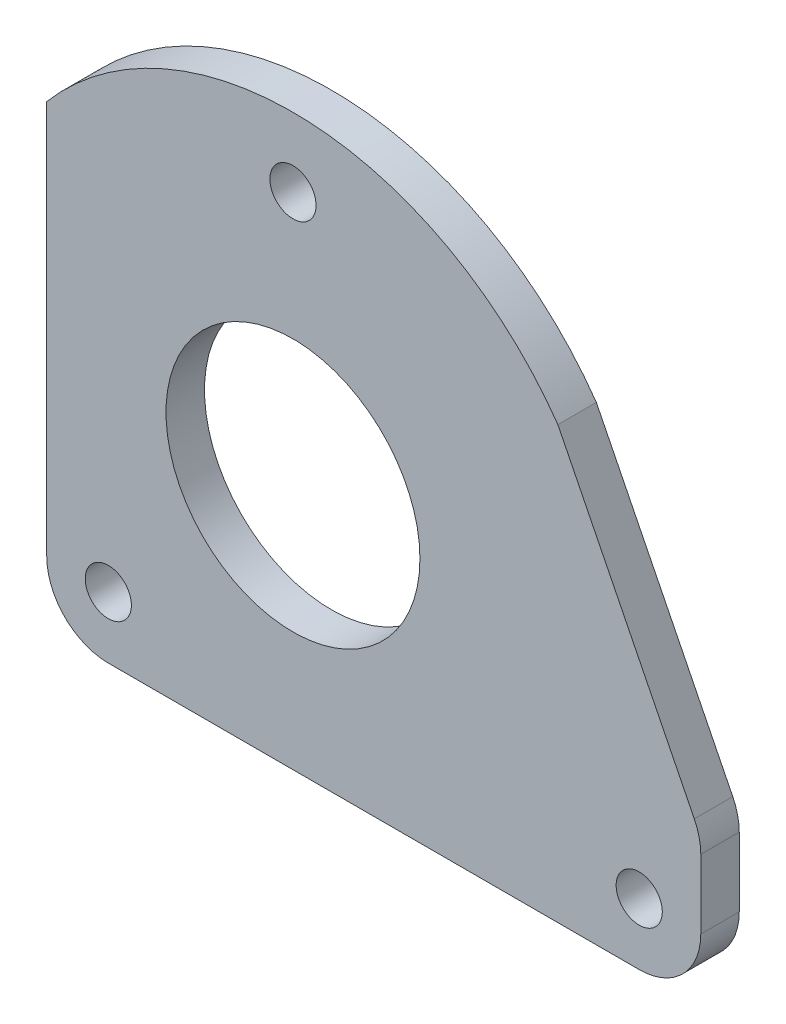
ISO-10303-21;
HEADER;
FILE_DESCRIPTION(('STEP AP214'),'2;1');
FILE_NAME('part.step','',(''),(''),'','','');
FILE_SCHEMA(('AUTOMOTIVE_DESIGN { 1 0 10303 214 1 1 1 1 }'));
ENDSEC;
DATA;
#1=APPLICATION_CONTEXT('core data for automotive mechanical design processes');
#2=APPLICATION_PROTOCOL_DEFINITION('international standard','automotive_design',2000,#1);
#3=PRODUCT_CONTEXT('',#1,'mechanical');
#4=PRODUCT('Part','Part','',(#3));
#5=PRODUCT_RELATED_PRODUCT_CATEGORY('part','',(#4));
#6=PRODUCT_DEFINITION_FORMATION('','',#4);
#7=PRODUCT_DEFINITION_CONTEXT('part definition',#1,'design');
#8=PRODUCT_DEFINITION('design','',#6,#7);
#9=PRODUCT_DEFINITION_SHAPE('','',#8);
#10=(LENGTH_UNIT() NAMED_UNIT(*) SI_UNIT(.MILLI.,.METRE.));
#11=(NAMED_UNIT(*) PLANE_ANGLE_UNIT() SI_UNIT($,.RADIAN.));
#12=(NAMED_UNIT(*) SI_UNIT($,.STERADIAN.) SOLID_ANGLE_UNIT());
#13=UNCERTAINTY_MEASURE_WITH_UNIT(LENGTH_MEASURE(1.E-05),#10,'distance_accuracy_value','');
#14=(GEOMETRIC_REPRESENTATION_CONTEXT(3) GLOBAL_UNCERTAINTY_ASSIGNED_CONTEXT((#13)) GLOBAL_UNIT_ASSIGNED_CONTEXT((#10,
#11,#12)) REPRESENTATION_CONTEXT('',''));
#15=CARTESIAN_POINT('',(0.,0.,0.));
#16=DIRECTION('',(0.,0.,1.));
#17=DIRECTION('',(1.,0.,0.));
#18=AXIS2_PLACEMENT_3D('',#15,#16,#17);
#19=CARTESIAN_POINT('',(-6.69608691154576,-0.438281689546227,0.));
#20=DIRECTION('',(0.,0.,1.));
#21=DIRECTION('',(1.,0.,0.));
#22=AXIS2_PLACEMENT_3D('',#19,#20,#21);
#23=PLANE('',#22);
#24=CARTESIAN_POINT('',(-13.5,0.,0.));
#25=DIRECTION('',(0.,0.,1.));
#26=DIRECTION('',(1.,0.,0.));
#27=AXIS2_PLACEMENT_3D('',#24,#25,#26);
#28=CIRCLE('',#27,42.);
#29=CARTESIAN_POINT('',(20.9268092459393,24.0581546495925,0.));
#30=VERTEX_POINT('',#29);
#31=CARTESIAN_POINT('',(-45.5,27.2029410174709,0.));
#32=VERTEX_POINT('',#31);
#33=EDGE_CURVE('E81',#30,#32,#28,.T.);
#34=ORIENTED_EDGE('',*,*,#33,.F.);
#35=DIRECTION('',(-0.446727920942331,0.894669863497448,0.));
#36=VECTOR('',#35,1.);
#37=CARTESIAN_POINT('',(20.9268092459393,24.0581546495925,0.));
#38=LINE('',#37,#36);
#39=CARTESIAN_POINT('',(38.6573589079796,-11.4511289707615,0.));
#40=VERTEX_POINT('',#39);
#41=EDGE_CURVE('E86',#40,#30,#38,.T.);
#42=ORIENTED_EDGE('',*,*,#41,.F.);
#43=CARTESIAN_POINT('',(31.5,-15.0249523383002,0.));
#44=DIRECTION('',(0.,0.,1.));
#45=DIRECTION('',(1.,0.,0.));
#46=AXIS2_PLACEMENT_3D('',#43,#44,#45);
#47=CIRCLE('',#46,7.99999999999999);
#48=CARTESIAN_POINT('',(39.5,-15.0249523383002,0.));
#49=VERTEX_POINT('',#48);
#50=EDGE_CURVE('E104',#49,#40,#47,.T.);
#51=ORIENTED_EDGE('',*,*,#50,.F.);
#52=DIRECTION('',(0.,1.,0.));
#53=VECTOR('',#52,1.);
#54=CARTESIAN_POINT('',(39.5,-15.0249523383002,0.));
#55=LINE('',#54,#53);
#56=CARTESIAN_POINT('',(39.5,-24.,0.));
#57=VERTEX_POINT('',#56);
#58=EDGE_CURVE('E109',#57,#49,#55,.T.);
#59=ORIENTED_EDGE('',*,*,#58,.F.);
#60=CARTESIAN_POINT('',(31.5,-24.,0.));
#61=DIRECTION('',(0.,0.,1.));
#62=DIRECTION('',(1.,0.,0.));
#63=AXIS2_PLACEMENT_3D('',#60,#61,#62);
#64=CIRCLE('',#63,8.);
#65=CARTESIAN_POINT('',(31.5,-32.,0.));
#66=VERTEX_POINT('',#65);
#67=EDGE_CURVE('E143',#66,#57,#64,.T.);
#68=ORIENTED_EDGE('',*,*,#67,.F.);
#69=DIRECTION('',(1.,0.,0.));
#70=VECTOR('',#69,1.);
#71=CARTESIAN_POINT('',(31.5,-32.,0.));
#72=LINE('',#71,#70);
#73=CARTESIAN_POINT('',(-37.5,-32.,0.));
#74=VERTEX_POINT('',#73);
#75=EDGE_CURVE('E113',#74,#66,#72,.T.);
#76=ORIENTED_EDGE('',*,*,#75,.F.);
#77=CARTESIAN_POINT('',(-37.5,-24.,0.));
#78=DIRECTION('',(0.,0.,1.));
#79=DIRECTION('',(1.,0.,0.));
#80=AXIS2_PLACEMENT_3D('',#77,#78,#79);
#81=CIRCLE('',#80,7.99999999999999);
#82=CARTESIAN_POINT('',(-45.5,-24.,0.));
#83=VERTEX_POINT('',#82);
#84=EDGE_CURVE('E145',#83,#74,#81,.T.);
#85=ORIENTED_EDGE('',*,*,#84,.F.);
#86=DIRECTION('',(0.,-1.,0.));
#87=VECTOR('',#86,1.);
#88=CARTESIAN_POINT('',(-45.5,-24.,0.));
#89=LINE('',#88,#87);
#90=EDGE_CURVE('E88',#32,#83,#89,.T.);
#91=ORIENTED_EDGE('',*,*,#90,.F.);
#92=EDGE_LOOP('',(#34,#42,#51,#59,#68,#76,#85,#91));
#93=FACE_BOUND('',#92,.T.);
#94=CARTESIAN_POINT('',(-37.5,-24.,0.));
#95=DIRECTION('',(0.,0.,1.));
#96=DIRECTION('',(1.,0.,0.));
#97=AXIS2_PLACEMENT_3D('',#94,#95,#96);
#98=CIRCLE('',#97,3.);
#99=CARTESIAN_POINT('',(-34.5,-24.,0.));
#100=VERTEX_POINT('',#99);
#101=EDGE_CURVE('E92',#100,#100,#98,.T.);
#102=ORIENTED_EDGE('',*,*,#101,.T.);
#103=EDGE_LOOP('',(#102));
#104=FACE_BOUND('',#103,.T.);
#105=CARTESIAN_POINT('',(31.5,-24.,0.));
#106=DIRECTION('',(0.,0.,1.));
#107=DIRECTION('',(1.,0.,0.));
#108=AXIS2_PLACEMENT_3D('',#105,#106,#107);
#109=CIRCLE('',#108,3.);
#110=CARTESIAN_POINT('',(34.5,-24.,0.));
#111=VERTEX_POINT('',#110);
#112=EDGE_CURVE('E149',#111,#111,#109,.T.);
#113=ORIENTED_EDGE('',*,*,#112,.T.);
#114=EDGE_LOOP('',(#113));
#115=FACE_BOUND('',#114,.T.);
#116=CARTESIAN_POINT('',(-13.5,33.,0.));
#117=DIRECTION('',(0.,0.,1.));
#118=DIRECTION('',(1.,0.,0.));
#119=AXIS2_PLACEMENT_3D('',#116,#117,#118);
#120=CIRCLE('',#119,3.);
#121=CARTESIAN_POINT('',(-10.5,33.,0.));
#122=VERTEX_POINT('',#121);
#123=EDGE_CURVE('E151',#122,#122,#120,.T.);
#124=ORIENTED_EDGE('',*,*,#123,.T.);
#125=EDGE_LOOP('',(#124));
#126=FACE_BOUND('',#125,.T.);
#127=CARTESIAN_POINT('',(-13.5,0.,0.));
#128=DIRECTION('',(0.,0.,1.));
#129=DIRECTION('',(1.,0.,0.));
#130=AXIS2_PLACEMENT_3D('',#127,#128,#129);
#131=CIRCLE('',#130,16.5);
#132=CARTESIAN_POINT('',(3.,0.,0.));
#133=VERTEX_POINT('',#132);
#134=EDGE_CURVE('E21',#133,#133,#131,.T.);
#135=ORIENTED_EDGE('',*,*,#134,.T.);
#136=EDGE_LOOP('',(#135));
#137=FACE_BOUND('',#136,.T.);
#138=ADVANCED_FACE('F17',(#93,#104,#115,#126,#137),#23,.F.);
#139=CARTESIAN_POINT('',(-13.5,0.,0.));
#140=DIRECTION('',(0.,0.,1.));
#141=DIRECTION('',(1.,0.,0.));
#142=AXIS2_PLACEMENT_3D('',#139,#140,#141);
#143=CYLINDRICAL_SURFACE('',#142,16.5);
#144=ORIENTED_EDGE('',*,*,#134,.F.);
#145=EDGE_LOOP('',(#144));
#146=FACE_BOUND('',#145,.T.);
#147=CARTESIAN_POINT('',(-13.5,0.,5.));
#148=DIRECTION('',(0.,0.,1.));
#149=DIRECTION('',(1.,0.,0.));
#150=AXIS2_PLACEMENT_3D('',#147,#148,#149);
#151=CIRCLE('',#150,16.5);
#152=CARTESIAN_POINT('',(3.,0.,5.));
#153=VERTEX_POINT('',#152);
#154=EDGE_CURVE('E100',#153,#153,#151,.F.);
#155=ORIENTED_EDGE('',*,*,#154,.F.);
#156=EDGE_LOOP('',(#155));
#157=FACE_BOUND('',#156,.T.);
#158=ADVANCED_FACE('F159',(#146,#157),#143,.F.);
#159=CARTESIAN_POINT('',(-13.5,33.,0.));
#160=DIRECTION('',(0.,0.,1.));
#161=DIRECTION('',(1.,0.,0.));
#162=AXIS2_PLACEMENT_3D('',#159,#160,#161);
#163=CYLINDRICAL_SURFACE('',#162,3.);
#164=ORIENTED_EDGE('',*,*,#123,.F.);
#165=EDGE_LOOP('',(#164));
#166=FACE_BOUND('',#165,.T.);
#167=CARTESIAN_POINT('',(-13.5,33.,5.));
#168=DIRECTION('',(0.,0.,1.));
#169=DIRECTION('',(1.,0.,0.));
#170=AXIS2_PLACEMENT_3D('',#167,#168,#169);
#171=CIRCLE('',#170,3.);
#172=CARTESIAN_POINT('',(-10.5,33.,5.));
#173=VERTEX_POINT('',#172);
#174=EDGE_CURVE('E137',#173,#173,#171,.F.);
#175=ORIENTED_EDGE('',*,*,#174,.F.);
#176=EDGE_LOOP('',(#175));
#177=FACE_BOUND('',#176,.T.);
#178=ADVANCED_FACE('F162',(#166,#177),#163,.F.);
#179=CARTESIAN_POINT('',(31.5,-24.,0.));
#180=DIRECTION('',(0.,0.,1.));
#181=DIRECTION('',(1.,0.,0.));
#182=AXIS2_PLACEMENT_3D('',#179,#180,#181);
#183=CYLINDRICAL_SURFACE('',#182,3.);
#184=ORIENTED_EDGE('',*,*,#112,.F.);
#185=EDGE_LOOP('',(#184));
#186=FACE_BOUND('',#185,.T.);
#187=CARTESIAN_POINT('',(31.5,-24.,5.));
#188=DIRECTION('',(0.,0.,1.));
#189=DIRECTION('',(1.,0.,0.));
#190=AXIS2_PLACEMENT_3D('',#187,#188,#189);
#191=CIRCLE('',#190,3.);
#192=CARTESIAN_POINT('',(34.5,-24.,5.));
#193=VERTEX_POINT('',#192);
#194=EDGE_CURVE('E134',#193,#193,#191,.F.);
#195=ORIENTED_EDGE('',*,*,#194,.F.);
#196=EDGE_LOOP('',(#195));
#197=FACE_BOUND('',#196,.T.);
#198=ADVANCED_FACE('F182',(#186,#197),#183,.F.);
#199=CARTESIAN_POINT('',(-37.5,-24.,0.));
#200=DIRECTION('',(0.,0.,1.));
#201=DIRECTION('',(1.,0.,0.));
#202=AXIS2_PLACEMENT_3D('',#199,#200,#201);
#203=CYLINDRICAL_SURFACE('',#202,3.);
#204=ORIENTED_EDGE('',*,*,#101,.F.);
#205=EDGE_LOOP('',(#204));
#206=FACE_BOUND('',#205,.T.);
#207=CARTESIAN_POINT('',(-37.5,-24.,5.));
#208=DIRECTION('',(0.,0.,1.));
#209=DIRECTION('',(1.,0.,0.));
#210=AXIS2_PLACEMENT_3D('',#207,#208,#209);
#211=CIRCLE('',#210,3.);
#212=CARTESIAN_POINT('',(-34.5,-24.,5.));
#213=VERTEX_POINT('',#212);
#214=EDGE_CURVE('E131',#213,#213,#211,.F.);
#215=ORIENTED_EDGE('',*,*,#214,.F.);
#216=EDGE_LOOP('',(#215));
#217=FACE_BOUND('',#216,.T.);
#218=ADVANCED_FACE('F188',(#206,#217),#203,.F.);
#219=CARTESIAN_POINT('',(-13.5,0.,0.));
#220=DIRECTION('',(0.,0.,1.));
#221=DIRECTION('',(1.,0.,0.));
#222=AXIS2_PLACEMENT_3D('',#219,#220,#221);
#223=CYLINDRICAL_SURFACE('',#222,42.);
#224=ORIENTED_EDGE('',*,*,#33,.T.);
#225=DIRECTION('',(0.,0.,1.));
#226=VECTOR('',#225,1.);
#227=CARTESIAN_POINT('',(-45.5,27.2029410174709,0.));
#228=LINE('',#227,#226);
#229=CARTESIAN_POINT('',(-45.5,27.2029410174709,5.));
#230=VERTEX_POINT('',#229);
#231=EDGE_CURVE('E91',#230,#32,#228,.F.);
#232=ORIENTED_EDGE('',*,*,#231,.F.);
#233=CARTESIAN_POINT('',(-13.5,0.,5.));
#234=DIRECTION('',(0.,0.,1.));
#235=DIRECTION('',(1.,0.,0.));
#236=AXIS2_PLACEMENT_3D('',#233,#234,#235);
#237=CIRCLE('',#236,42.);
#238=CARTESIAN_POINT('',(20.9268092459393,24.0581546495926,5.));
#239=VERTEX_POINT('',#238);
#240=EDGE_CURVE('E98',#239,#230,#237,.T.);
#241=ORIENTED_EDGE('',*,*,#240,.F.);
#242=DIRECTION('',(0.,0.,1.));
#243=VECTOR('',#242,1.);
#244=CARTESIAN_POINT('',(20.9268092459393,24.0581546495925,0.));
#245=LINE('',#244,#243);
#246=EDGE_CURVE('E95',#30,#239,#245,.T.);
#247=ORIENTED_EDGE('',*,*,#246,.F.);
#248=EDGE_LOOP('',(#224,#232,#241,#247));
#249=FACE_BOUND('',#248,.T.);
#250=ADVANCED_FACE('F96',(#249),#223,.T.);
#251=CARTESIAN_POINT('',(-45.5,-24.,0.));
#252=DIRECTION('',(-1.,0.,0.));
#253=DIRECTION('',(0.,-1.,0.));
#254=AXIS2_PLACEMENT_3D('',#251,#252,#253);
#255=PLANE('',#254);
#256=ORIENTED_EDGE('',*,*,#90,.T.);
#257=DIRECTION('',(0.,0.,1.));
#258=VECTOR('',#257,1.);
#259=CARTESIAN_POINT('',(-45.5,-24.,0.));
#260=LINE('',#259,#258);
#261=CARTESIAN_POINT('',(-45.5,-24.,5.));
#262=VERTEX_POINT('',#261);
#263=EDGE_CURVE('E118',#262,#83,#260,.F.);
#264=ORIENTED_EDGE('',*,*,#263,.F.);
#265=DIRECTION('',(0.,1.,0.));
#266=VECTOR('',#265,1.);
#267=CARTESIAN_POINT('',(-45.5,-0.438281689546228,5.));
#268=LINE('',#267,#266);
#269=EDGE_CURVE('E129',#230,#262,#268,.F.);
#270=ORIENTED_EDGE('',*,*,#269,.F.);
#271=ORIENTED_EDGE('',*,*,#231,.T.);
#272=EDGE_LOOP('',(#256,#264,#270,#271));
#273=FACE_BOUND('',#272,.T.);
#274=ADVANCED_FACE('F198',(#273),#255,.T.);
#275=CARTESIAN_POINT('',(-37.5,-24.,0.));
#276=DIRECTION('',(0.,0.,1.));
#277=DIRECTION('',(1.,0.,0.));
#278=AXIS2_PLACEMENT_3D('',#275,#276,#277);
#279=CYLINDRICAL_SURFACE('',#278,7.99999999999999);
#280=ORIENTED_EDGE('',*,*,#84,.T.);
#281=DIRECTION('',(0.,0.,1.));
#282=VECTOR('',#281,1.);
#283=CARTESIAN_POINT('',(-37.5,-32.,0.));
#284=LINE('',#283,#282);
#285=CARTESIAN_POINT('',(-37.5,-32.,5.));
#286=VERTEX_POINT('',#285);
#287=EDGE_CURVE('E116',#286,#74,#284,.F.);
#288=ORIENTED_EDGE('',*,*,#287,.F.);
#289=CARTESIAN_POINT('',(-37.5,-24.,5.));
#290=DIRECTION('',(0.,0.,1.));
#291=DIRECTION('',(1.,0.,0.));
#292=AXIS2_PLACEMENT_3D('',#289,#290,#291);
#293=CIRCLE('',#292,7.99999999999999);
#294=EDGE_CURVE('E126',#262,#286,#293,.T.);
#295=ORIENTED_EDGE('',*,*,#294,.F.);
#296=ORIENTED_EDGE('',*,*,#263,.T.);
#297=EDGE_LOOP('',(#280,#288,#295,#296));
#298=FACE_BOUND('',#297,.T.);
#299=ADVANCED_FACE('F201',(#298),#279,.T.);
#300=CARTESIAN_POINT('',(31.5,-32.,0.));
#301=DIRECTION('',(0.,-1.,0.));
#302=DIRECTION('',(1.,0.,0.));
#303=AXIS2_PLACEMENT_3D('',#300,#301,#302);
#304=PLANE('',#303);
#305=ORIENTED_EDGE('',*,*,#75,.T.);
#306=DIRECTION('',(0.,0.,1.));
#307=VECTOR('',#306,1.);
#308=CARTESIAN_POINT('',(31.5,-32.,0.));
#309=LINE('',#308,#307);
#310=CARTESIAN_POINT('',(31.5,-32.,5.));
#311=VERTEX_POINT('',#310);
#312=EDGE_CURVE('E115',#311,#66,#309,.F.);
#313=ORIENTED_EDGE('',*,*,#312,.F.);
#314=DIRECTION('',(1.,0.,0.));
#315=VECTOR('',#314,1.);
#316=CARTESIAN_POINT('',(-6.69608691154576,-32.,5.));
#317=LINE('',#316,#315);
#318=EDGE_CURVE('E125',#286,#311,#317,.T.);
#319=ORIENTED_EDGE('',*,*,#318,.F.);
#320=ORIENTED_EDGE('',*,*,#287,.T.);
#321=EDGE_LOOP('',(#305,#313,#319,#320));
#322=FACE_BOUND('',#321,.T.);
#323=ADVANCED_FACE('F205',(#322),#304,.T.);
#324=CARTESIAN_POINT('',(31.5,-24.,0.));
#325=DIRECTION('',(0.,0.,1.));
#326=DIRECTION('',(1.,0.,0.));
#327=AXIS2_PLACEMENT_3D('',#324,#325,#326);
#328=CYLINDRICAL_SURFACE('',#327,8.);
#329=ORIENTED_EDGE('',*,*,#67,.T.);
#330=DIRECTION('',(0.,0.,-1.));
#331=VECTOR('',#330,1.);
#332=CARTESIAN_POINT('',(39.5,-24.,0.));
#333=LINE('',#332,#331);
#334=CARTESIAN_POINT('',(39.5,-24.,5.));
#335=VERTEX_POINT('',#334);
#336=EDGE_CURVE('E112',#335,#57,#333,.T.);
#337=ORIENTED_EDGE('',*,*,#336,.F.);
#338=CARTESIAN_POINT('',(31.5,-24.,5.));
#339=DIRECTION('',(0.,0.,1.));
#340=DIRECTION('',(1.,0.,0.));
#341=AXIS2_PLACEMENT_3D('',#338,#339,#340);
#342=CIRCLE('',#341,8.);
#343=EDGE_CURVE('E122',#311,#335,#342,.T.);
#344=ORIENTED_EDGE('',*,*,#343,.F.);
#345=ORIENTED_EDGE('',*,*,#312,.T.);
#346=EDGE_LOOP('',(#329,#337,#344,#345));
#347=FACE_BOUND('',#346,.T.);
#348=ADVANCED_FACE('F209',(#347),#328,.T.);
#349=CARTESIAN_POINT('',(39.5,-15.0249523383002,0.));
#350=DIRECTION('',(1.,0.,0.));
#351=DIRECTION('',(0.,0.,-1.));
#352=AXIS2_PLACEMENT_3D('',#349,#350,#351);
#353=PLANE('',#352);
#354=ORIENTED_EDGE('',*,*,#58,.T.);
#355=DIRECTION('',(0.,0.,1.));
#356=VECTOR('',#355,1.);
#357=CARTESIAN_POINT('',(39.5,-15.0249523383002,0.));
#358=LINE('',#357,#356);
#359=CARTESIAN_POINT('',(39.5,-15.0249523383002,5.));
#360=VERTEX_POINT('',#359);
#361=EDGE_CURVE('E111',#360,#49,#358,.F.);
#362=ORIENTED_EDGE('',*,*,#361,.F.);
#363=DIRECTION('',(0.,1.,0.));
#364=VECTOR('',#363,1.);
#365=CARTESIAN_POINT('',(39.5,-0.438281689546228,5.));
#366=LINE('',#365,#364);
#367=EDGE_CURVE('E121',#335,#360,#366,.T.);
#368=ORIENTED_EDGE('',*,*,#367,.F.);
#369=ORIENTED_EDGE('',*,*,#336,.T.);
#370=EDGE_LOOP('',(#354,#362,#368,#369));
#371=FACE_BOUND('',#370,.T.);
#372=ADVANCED_FACE('F213',(#371),#353,.T.);
#373=CARTESIAN_POINT('',(31.5,-15.0249523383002,0.));
#374=DIRECTION('',(0.,0.,1.));
#375=DIRECTION('',(1.,0.,0.));
#376=AXIS2_PLACEMENT_3D('',#373,#374,#375);
#377=CYLINDRICAL_SURFACE('',#376,7.99999999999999);
#378=ORIENTED_EDGE('',*,*,#50,.T.);
#379=DIRECTION('',(0.,0.,1.));
#380=VECTOR('',#379,1.);
#381=CARTESIAN_POINT('',(38.6573589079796,-11.4511289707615,0.));
#382=LINE('',#381,#380);
#383=CARTESIAN_POINT('',(38.6573589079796,-11.4511289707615,5.));
#384=VERTEX_POINT('',#383);
#385=EDGE_CURVE('E36',#384,#40,#382,.F.);
#386=ORIENTED_EDGE('',*,*,#385,.F.);
#387=CARTESIAN_POINT('',(31.5,-15.0249523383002,5.));
#388=DIRECTION('',(0.,0.,1.));
#389=DIRECTION('',(1.,0.,0.));
#390=AXIS2_PLACEMENT_3D('',#387,#388,#389);
#391=CIRCLE('',#390,7.99999999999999);
#392=EDGE_CURVE('E27',#360,#384,#391,.T.);
#393=ORIENTED_EDGE('',*,*,#392,.F.);
#394=ORIENTED_EDGE('',*,*,#361,.T.);
#395=EDGE_LOOP('',(#378,#386,#393,#394));
#396=FACE_BOUND('',#395,.T.);
#397=ADVANCED_FACE('F172',(#396),#377,.T.);
#398=CARTESIAN_POINT('',(20.9268092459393,24.0581546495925,0.));
#399=DIRECTION('',(0.894669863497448,0.446727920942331,0.));
#400=DIRECTION('',(-0.446727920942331,0.894669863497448,0.));
#401=AXIS2_PLACEMENT_3D('',#398,#399,#400);
#402=PLANE('',#401);
#403=ORIENTED_EDGE('',*,*,#41,.T.);
#404=ORIENTED_EDGE('',*,*,#246,.T.);
#405=DIRECTION('',(-0.446727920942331,0.894669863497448,0.));
#406=VECTOR('',#405,1.);
#407=CARTESIAN_POINT('',(38.6573589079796,-11.4511289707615,5.));
#408=LINE('',#407,#406);
#409=EDGE_CURVE('E11',#384,#239,#408,.T.);
#410=ORIENTED_EDGE('',*,*,#409,.F.);
#411=ORIENTED_EDGE('',*,*,#385,.T.);
#412=EDGE_LOOP('',(#403,#404,#410,#411));
#413=FACE_BOUND('',#412,.T.);
#414=ADVANCED_FACE('F102',(#413),#402,.T.);
#415=CARTESIAN_POINT('',(-6.69608691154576,-0.438281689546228,5.));
#416=DIRECTION('',(0.,0.,1.));
#417=DIRECTION('',(1.,0.,0.));
#418=AXIS2_PLACEMENT_3D('',#415,#416,#417);
#419=PLANE('',#418);
#420=ORIENTED_EDGE('',*,*,#392,.T.);
#421=ORIENTED_EDGE('',*,*,#409,.T.);
#422=ORIENTED_EDGE('',*,*,#240,.T.);
#423=ORIENTED_EDGE('',*,*,#269,.T.);
#424=ORIENTED_EDGE('',*,*,#294,.T.);
#425=ORIENTED_EDGE('',*,*,#318,.T.);
#426=ORIENTED_EDGE('',*,*,#343,.T.);
#427=ORIENTED_EDGE('',*,*,#367,.T.);
#428=EDGE_LOOP('',(#420,#421,#422,#423,#424,#425,#426,#427));
#429=FACE_BOUND('',#428,.T.);
#430=ORIENTED_EDGE('',*,*,#214,.T.);
#431=EDGE_LOOP('',(#430));
#432=FACE_BOUND('',#431,.T.);
#433=ORIENTED_EDGE('',*,*,#194,.T.);
#434=EDGE_LOOP('',(#433));
#435=FACE_BOUND('',#434,.T.);
#436=ORIENTED_EDGE('',*,*,#174,.T.);
#437=EDGE_LOOP('',(#436));
#438=FACE_BOUND('',#437,.T.);
#439=ORIENTED_EDGE('',*,*,#154,.T.);
#440=EDGE_LOOP('',(#439));
#441=FACE_BOUND('',#440,.T.);
#442=ADVANCED_FACE('F19',(#429,#432,#435,#438,#441),#419,.T.);
#443=CLOSED_SHELL('',(#138,#158,#178,#198,#218,#250,#274,#299,#323,#348,#372,#397,#414,#442));
#444=MANIFOLD_SOLID_BREP('B1',#443);
#445=ADVANCED_BREP_SHAPE_REPRESENTATION('',(#18,#444),#14);
#446=SHAPE_DEFINITION_REPRESENTATION(#9,#445);
ENDSEC;
END-ISO-10303-21;
